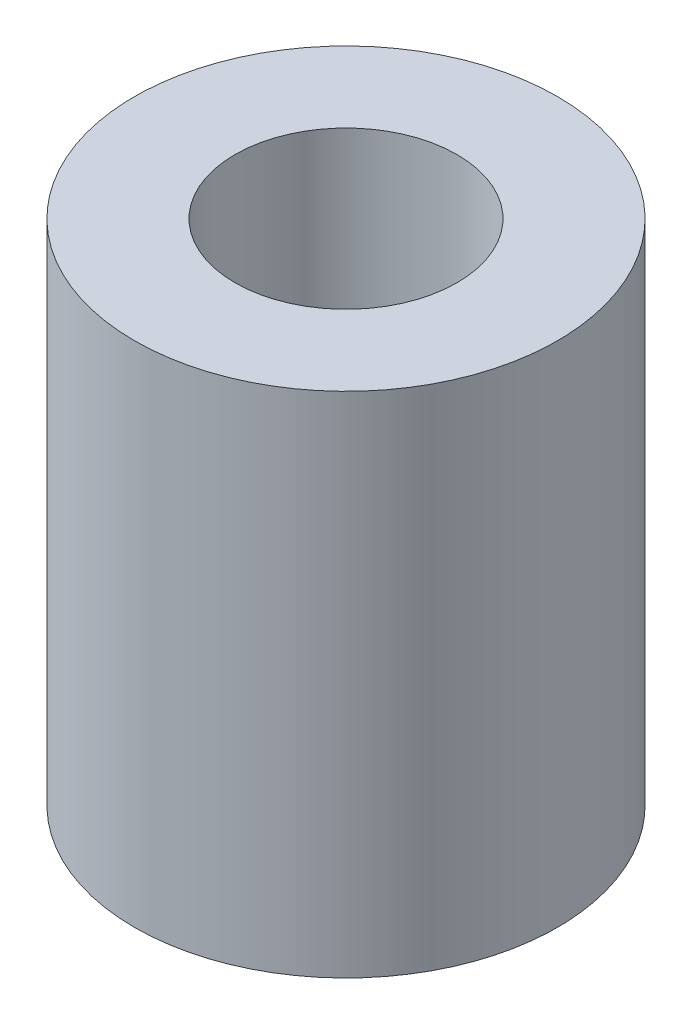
from build123d import *

# Parameters (mm, degrees)
SKETCH1_R           = 4
SKETCH1_R_2         = 2.1
BOSS_EXTRUDE1_DEPTH = 9.61


with BuildPart() as part:
    # Sketch1 → Boss-Extrude1 (new body)
    with BuildSketch(Plane(origin=(0, 0, 0), x_dir=(1, 0, 0), z_dir=(0, 1, 0))):
        with Locations(Location((0, 0, 0), (0, 0, 270))):
            Circle(SKETCH1_R)
        with Locations(Location((0, 0, 0), (0, 0, 270))):
            Circle(SKETCH1_R_2, mode=Mode.SUBTRACT)
    extrude(amount=BOSS_EXTRUDE1_DEPTH)


solid = part.part
